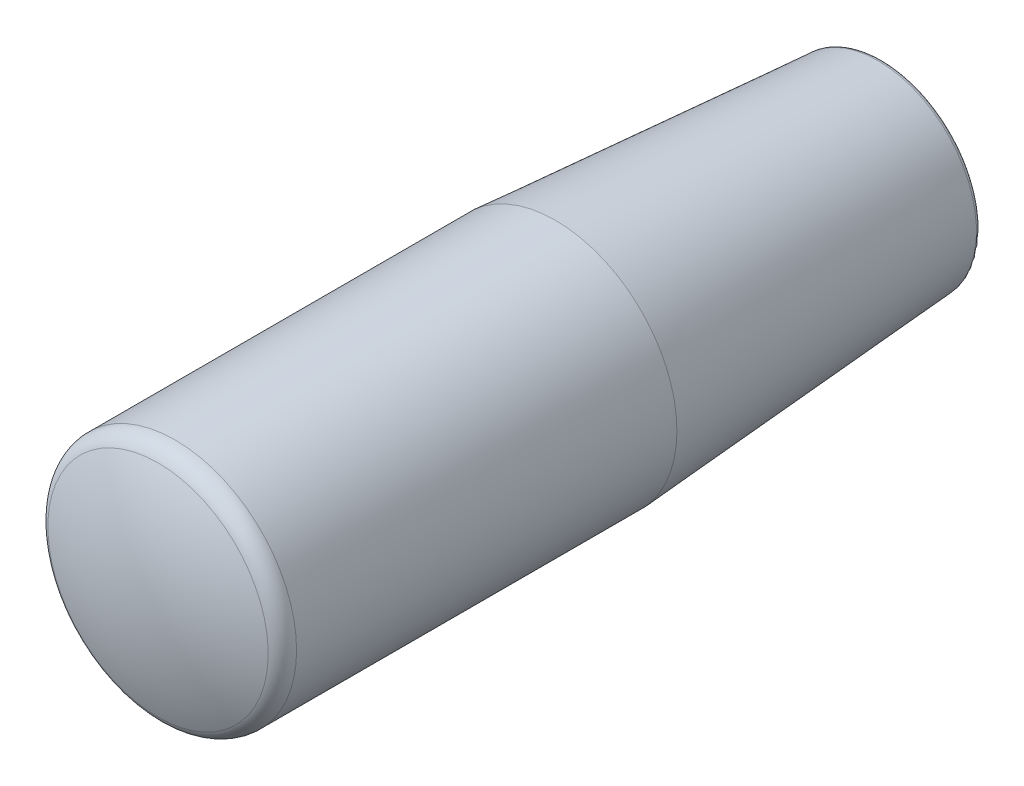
ISO-10303-21;
HEADER;
FILE_DESCRIPTION(('STEP AP214'),'2;1');
FILE_NAME('part.step','',(''),(''),'','','');
FILE_SCHEMA(('AUTOMOTIVE_DESIGN { 1 0 10303 214 1 1 1 1 }'));
ENDSEC;
DATA;
#1=APPLICATION_CONTEXT('core data for automotive mechanical design processes');
#2=APPLICATION_PROTOCOL_DEFINITION('international standard','automotive_design',2000,#1);
#3=PRODUCT_CONTEXT('',#1,'mechanical');
#4=PRODUCT('Part','Part','',(#3));
#5=PRODUCT_RELATED_PRODUCT_CATEGORY('part','',(#4));
#6=PRODUCT_DEFINITION_FORMATION('','',#4);
#7=PRODUCT_DEFINITION_CONTEXT('part definition',#1,'design');
#8=PRODUCT_DEFINITION('design','',#6,#7);
#9=PRODUCT_DEFINITION_SHAPE('','',#8);
#10=(LENGTH_UNIT() NAMED_UNIT(*) SI_UNIT(.MILLI.,.METRE.));
#11=(NAMED_UNIT(*) PLANE_ANGLE_UNIT() SI_UNIT($,.RADIAN.));
#12=(NAMED_UNIT(*) SI_UNIT($,.STERADIAN.) SOLID_ANGLE_UNIT());
#13=UNCERTAINTY_MEASURE_WITH_UNIT(LENGTH_MEASURE(1.E-05),#10,'distance_accuracy_value','');
#14=(GEOMETRIC_REPRESENTATION_CONTEXT(3) GLOBAL_UNCERTAINTY_ASSIGNED_CONTEXT((#13)) GLOBAL_UNIT_ASSIGNED_CONTEXT((#10,
#11,#12)) REPRESENTATION_CONTEXT('',''));
#15=CARTESIAN_POINT('',(0.,0.,0.));
#16=DIRECTION('',(0.,0.,1.));
#17=DIRECTION('',(1.,0.,0.));
#18=AXIS2_PLACEMENT_3D('',#15,#16,#17);
#19=CARTESIAN_POINT('',(0.,0.,0.499999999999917));
#20=DIRECTION('',(0.,0.,-1.));
#21=DIRECTION('',(0.,-1.,0.));
#22=AXIS2_PLACEMENT_3D('',#19,#20,#21);
#23=TOROIDAL_SURFACE('',#22,10.0344403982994,0.499999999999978);
#24=CARTESIAN_POINT('',(0.,0.,0.));
#25=DIRECTION('',(0.,0.,-1.));
#26=DIRECTION('',(0.,-1.,0.));
#27=AXIS2_PLACEMENT_3D('',#24,#25,#26);
#28=CIRCLE('',#27,10.0344403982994);
#29=CARTESIAN_POINT('',(0.,-10.0344403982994,0.));
#30=VERTEX_POINT('',#29);
#31=EDGE_CURVE('E8',#30,#30,#28,.T.);
#32=ORIENTED_EDGE('',*,*,#31,.F.);
#33=EDGE_LOOP('',(#32));
#34=FACE_BOUND('',#33,.T.);
#35=CARTESIAN_POINT('',(0.,0.,0.464376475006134));
#36=DIRECTION('',(0.,0.,-1.));
#37=DIRECTION('',(0.,-1.,0.));
#38=AXIS2_PLACEMENT_3D('',#35,#36,#37);
#39=CIRCLE('',#38,10.5331697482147);
#40=CARTESIAN_POINT('',(0.,-10.5331697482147,0.464376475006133));
#41=VERTEX_POINT('',#40);
#42=EDGE_CURVE('E37',#41,#41,#39,.T.);
#43=ORIENTED_EDGE('',*,*,#42,.T.);
#44=EDGE_LOOP('',(#43));
#45=FACE_BOUND('',#44,.T.);
#46=ADVANCED_FACE('F12',(#34,#45),#23,.T.);
#47=CARTESIAN_POINT('',(0.,10.0344403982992,0.));
#48=DIRECTION('',(0.,0.,1.));
#49=DIRECTION('',(0.,1.,0.));
#50=AXIS2_PLACEMENT_3D('',#47,#48,#49);
#51=PLANE('',#50);
#52=CARTESIAN_POINT('',(0.,0.,0.));
#53=DIRECTION('',(0.,0.,-1.));
#54=DIRECTION('',(0.,-1.,0.));
#55=AXIS2_PLACEMENT_3D('',#52,#53,#54);
#56=CIRCLE('',#55,7.);
#57=CARTESIAN_POINT('',(0.,-7.,0.));
#58=VERTEX_POINT('',#57);
#59=EDGE_CURVE('E18',#58,#58,#56,.T.);
#60=ORIENTED_EDGE('',*,*,#59,.F.);
#61=EDGE_LOOP('',(#60));
#62=FACE_BOUND('',#61,.T.);
#63=ORIENTED_EDGE('',*,*,#31,.T.);
#64=EDGE_LOOP('',(#63));
#65=FACE_BOUND('',#64,.T.);
#66=ADVANCED_FACE('F56',(#62,#65),#51,.F.);
#67=CARTESIAN_POINT('',(0.,0.,-5.00000000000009));
#68=DIRECTION('',(0.,0.,-1.));
#69=DIRECTION('',(0.,-1.,0.));
#70=AXIS2_PLACEMENT_3D('',#67,#68,#69);
#71=CYLINDRICAL_SURFACE('',#70,7.);
#72=CARTESIAN_POINT('',(0.,0.,50.));
#73=DIRECTION('',(0.,0.,-1.));
#74=DIRECTION('',(0.,-1.,0.));
#75=AXIS2_PLACEMENT_3D('',#72,#73,#74);
#76=CIRCLE('',#75,7.);
#77=CARTESIAN_POINT('',(0.,-6.99999999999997,50.));
#78=VERTEX_POINT('',#77);
#79=EDGE_CURVE('E22',#78,#78,#76,.T.);
#80=ORIENTED_EDGE('',*,*,#79,.F.);
#81=EDGE_LOOP('',(#80));
#82=FACE_BOUND('',#81,.T.);
#83=ORIENTED_EDGE('',*,*,#59,.T.);
#84=EDGE_LOOP('',(#83));
#85=FACE_BOUND('',#84,.T.);
#86=ADVANCED_FACE('F62',(#82,#85),#71,.F.);
#87=CARTESIAN_POINT('',(0.,6.99999999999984,50.));
#88=DIRECTION('',(0.,0.,1.));
#89=DIRECTION('',(0.,1.,0.));
#90=AXIS2_PLACEMENT_3D('',#87,#88,#89);
#91=PLANE('',#90);
#92=ORIENTED_EDGE('',*,*,#79,.T.);
#93=EDGE_LOOP('',(#92));
#94=FACE_BOUND('',#93,.T.);
#95=ADVANCED_FACE('F68',(#94),#91,.F.);
#96=CARTESIAN_POINT('',(0.,0.,50.3333333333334));
#97=DIRECTION('',(-1.,0.,0.));
#98=DIRECTION('',(0.,0.,1.));
#99=AXIS2_PLACEMENT_3D('',#96,#97,#98);
#100=SPHERICAL_SURFACE('',#99,29.6666666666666);
#101=CARTESIAN_POINT('',(0.,0.,50.3333333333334));
#102=DIRECTION('',(0.,0.,-1.));
#103=DIRECTION('',(0.,-1.,0.));
#104=AXIS2_PLACEMENT_3D('',#101,#102,#103);
#105=SPHERICAL_SURFACE('',#104,29.6666666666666);
#106=CARTESIAN_POINT('',(0.,-1.66533453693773E-13,77.5543697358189));
#107=DIRECTION('',(0.,0.,-1.));
#108=DIRECTION('',(0.,-1.,0.));
#109=AXIS2_PLACEMENT_3D('',#106,#107,#108);
#110=CIRCLE('',#109,11.7951807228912);
#111=CARTESIAN_POINT('',(0.,-11.7951807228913,77.5543697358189));
#112=VERTEX_POINT('',#111);
#113=EDGE_CURVE('E26',#112,#112,#110,.T.);
#114=ORIENTED_EDGE('',*,*,#113,.F.);
#115=EDGE_LOOP('',(#114));
#116=FACE_BOUND('',#115,.T.);
#117=ADVANCED_FACE('F74',(#116),#105,.T.);
#118=CARTESIAN_POINT('',(0.,-1.38777878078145E-13,75.7192436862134));
#119=DIRECTION('',(0.,0.,-1.));
#120=DIRECTION('',(0.,-1.,0.));
#121=AXIS2_PLACEMENT_3D('',#118,#119,#120);
#122=TOROIDAL_SURFACE('',#121,11.,1.99999999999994);
#123=CARTESIAN_POINT('',(0.,-1.38777878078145E-13,75.7192436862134));
#124=DIRECTION('',(0.,0.,-1.));
#125=DIRECTION('',(0.,-1.,0.));
#126=AXIS2_PLACEMENT_3D('',#123,#124,#125);
#127=CIRCLE('',#126,13.);
#128=CARTESIAN_POINT('',(0.,-13.0000000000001,75.7192436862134));
#129=VERTEX_POINT('',#128);
#130=EDGE_CURVE('E31',#129,#129,#127,.T.);
#131=ORIENTED_EDGE('',*,*,#130,.F.);
#132=EDGE_LOOP('',(#131));
#133=FACE_BOUND('',#132,.T.);
#134=ORIENTED_EDGE('',*,*,#113,.T.);
#135=EDGE_LOOP('',(#134));
#136=FACE_BOUND('',#135,.T.);
#137=ADVANCED_FACE('F52',(#133,#136),#122,.T.);
#138=CARTESIAN_POINT('',(0.,0.,-5.00000000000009));
#139=DIRECTION('',(0.,0.,-1.));
#140=DIRECTION('',(0.,-1.,0.));
#141=AXIS2_PLACEMENT_3D('',#138,#139,#140);
#142=CYLINDRICAL_SURFACE('',#141,13.);
#143=CARTESIAN_POINT('',(0.,0.,35.));
#144=DIRECTION('',(0.,0.,-1.));
#145=DIRECTION('',(0.,-1.,0.));
#146=AXIS2_PLACEMENT_3D('',#143,#144,#145);
#147=CIRCLE('',#146,13.);
#148=CARTESIAN_POINT('',(0.,-13.0000000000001,35.));
#149=VERTEX_POINT('',#148);
#150=EDGE_CURVE('E34',#149,#149,#147,.T.);
#151=ORIENTED_EDGE('',*,*,#150,.F.);
#152=EDGE_LOOP('',(#151));
#153=FACE_BOUND('',#152,.T.);
#154=ORIENTED_EDGE('',*,*,#130,.T.);
#155=EDGE_LOOP('',(#154));
#156=FACE_BOUND('',#155,.T.);
#157=ADVANCED_FACE('F44',(#153,#156),#142,.T.);
#158=CARTESIAN_POINT('',(0.,0.,0.464376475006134));
#159=DIRECTION('',(0.,0.,1.));
#160=DIRECTION('',(0.,1.,0.));
#161=AXIS2_PLACEMENT_3D('',#158,#159,#160);
#162=CONICAL_SURFACE('',#161,10.5331697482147,0.0713074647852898);
#163=ORIENTED_EDGE('',*,*,#150,.T.);
#164=EDGE_LOOP('',(#163));
#165=FACE_BOUND('',#164,.T.);
#166=ORIENTED_EDGE('',*,*,#42,.F.);
#167=EDGE_LOOP('',(#166));
#168=FACE_BOUND('',#167,.T.);
#169=ADVANCED_FACE('F42',(#165,#168),#162,.T.);
#170=CLOSED_SHELL('',(#46,#66,#86,#95,#117,#137,#157,#169));
#171=MANIFOLD_SOLID_BREP('B1',#170);
#172=ADVANCED_BREP_SHAPE_REPRESENTATION('',(#18,#171),#14);
#173=SHAPE_DEFINITION_REPRESENTATION(#9,#172);
ENDSEC;
END-ISO-10303-21;
